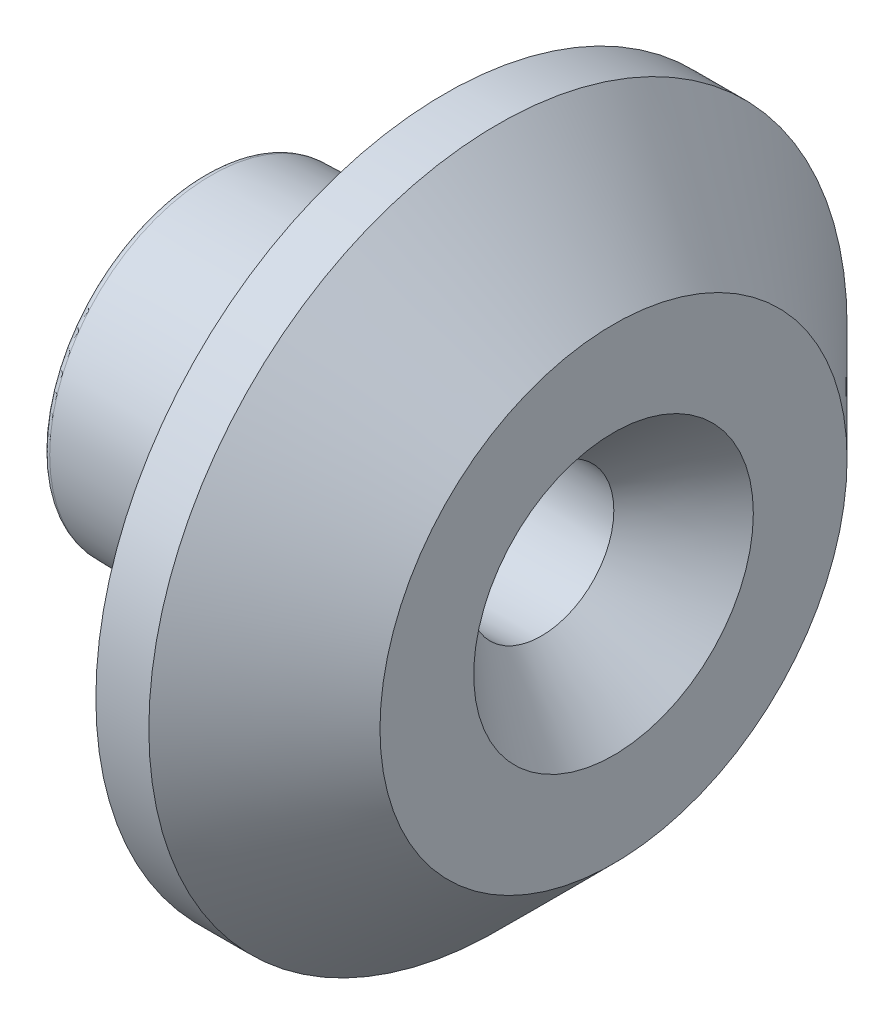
from build123d import *

# Parameters (mm, degrees)
ESQUISSE5_W             = 2
ESQUISSE5_H             = 5
CONG_3_R                = 0.3
ESQUISSE6_R             = 3.5
ENL_V_MAT_EXTRU_2_DEPTH = 27.636441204
ENL_V_MAT_EXTRU_2_DRAFT = -2
CONG_4_R                = 0.2
CHANFREIN3_SIZE         = 3
CHANFREIN3_SIZE2        = 2.90053956
ECHELLE1_SCALE          = 1.015


with BuildPart() as part:
    # Esquisse1 → R_volution1 (revolve)
    with BuildSketch(Plane.XY, mode=Mode.PRIVATE) as r_volution1_sk:
        Polygon((-10, 0), (-10, 6.7), (0, 7), (0, 14.5), (2.2, 14.5), (7, 9.7), (7, 0), align=None)
    revolve(r_volution1_sk.sketch.rotate(Axis((-64.738734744, 0, 0), (1, 0, 0)), 90), axis=Axis((-64.738734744, 0, 0), (1, 0, 0)))

    # Esquisse5 → Enl_vement de mati_re-R_volution3 (revolve, cut)
    with BuildSketch(Plane.XY, mode=Mode.PRIVATE) as enl_vement_de_mati_re_r_volution3_sk:
        with Locations((1, 9.5)):
            Rectangle(ESQUISSE5_W, ESQUISSE5_H)
    revolve(enl_vement_de_mati_re_r_volution3_sk.sketch.rotate(Axis((-53.221151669, 0, 0), (1, 0, 0)), 90), axis=Axis((-53.221151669, 0, 0), (1, 0, 0)), mode=Mode.SUBTRACT)

    # Cong_3
    cong_3_edges = [part.edges().sort_by_distance(p)[0] for p in [
        (2, 0, -12),
        (2, 0, -7),
        (-10, 0, -6.7),
    ]]
    fillet(cong_3_edges, radius=CONG_3_R)


with BuildPart() as enl_v_mat_extru_2_tool:
    # Esquisse6 → Enl_v. mat.-Extru.2 (with draft: the straight prism first)
    with BuildSketch(Plane.ZY.offset(10)):
        Circle(ESQUISSE6_R)
    extrude(amount=-ENL_V_MAT_EXTRU_2_DEPTH)
    # Enl_v. mat.-Extru.2: the draft: its side faces are tilted about the plane it starts from
    enl_v_mat_extru_2_sides = [enl_v_mat_extru_2_tool.faces().sort_by_distance(p)[0] for p in [
        (3.818220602, 0, -3.5),
    ]]
    draft(enl_v_mat_extru_2_sides, Plane.ZY.offset(10), ENL_V_MAT_EXTRU_2_DRAFT)


with BuildPart() as part_1:
    add(part.part)

    # Enl_v. mat.-Extru.2: cut by enl_v_mat_extru_2_tool
    add(enl_v_mat_extru_2_tool.part, mode=Mode.SUBTRACT)

    # Cong_4
    cong_4_edges = [part_1.edges().sort_by_distance(p)[0] for p in [
        (-10, 0, -3.5),
    ]]
    fillet(cong_4_edges, radius=CONG_4_R)

    # Chanfrein3
    chanfrein3_edges = [part_1.edges().sort_by_distance(p)[0] for p in [
        (7, 0, -2.906346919),
    ]]
    chanfrein3_side = [part_1.faces().sort_by_distance(p)[0] for p in [
        (-1.40348995, 0, -3.199803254),
    ]]
    chamfer(chanfrein3_edges, length=CHANFREIN3_SIZE, length2=CHANFREIN3_SIZE2, reference=chanfrein3_side[0])


with BuildPart() as part_2:
    # Echelle1: scaled about (0, 0, 0)
    add(part_1.part.scale(ECHELLE1_SCALE))


solid = part_2.part
